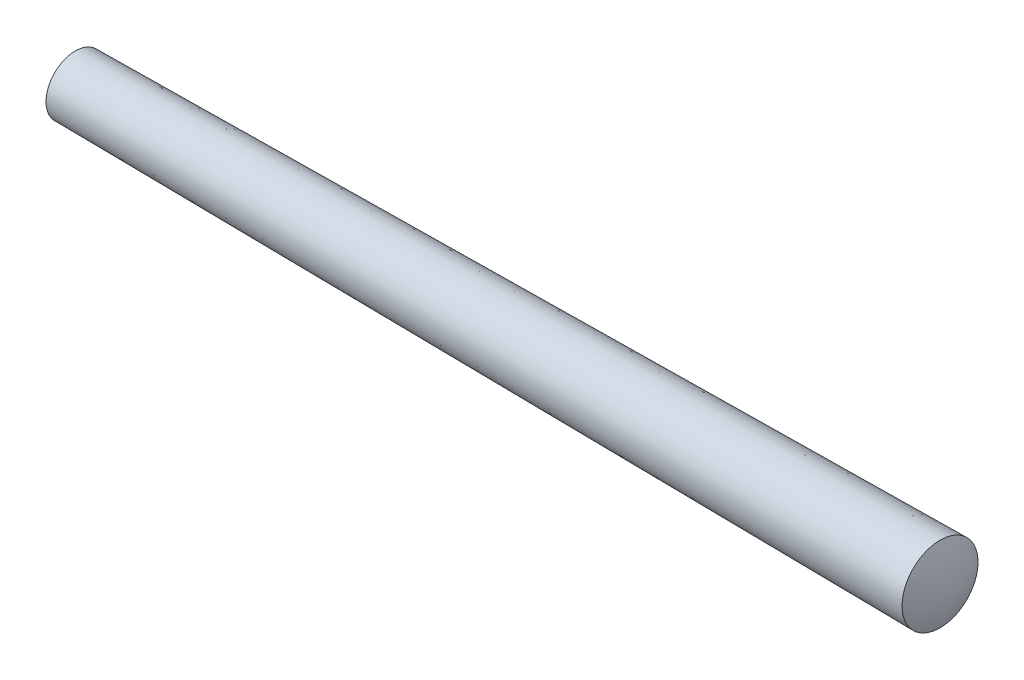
from build123d import *


with BuildPart() as part:
    # Sketch1 → Base-Revolve (revolve)
    with BuildSketch(Plane.XY):
        with BuildLine():
            Line((0.4, 1.5), (44.6, 1.941999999))
            ThreePointArc((44.6, 1.941999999), (44.898961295, 0.991383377), (45, 0))
            Line((45, 0), (0, 0))
            ThreePointArc((0, 0), (0.101717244, 0.776208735), (0.4, 1.5))
        make_face()
    revolve(axis=Axis((0, 0, 0), (1, 0, 0)))


solid = part.part
